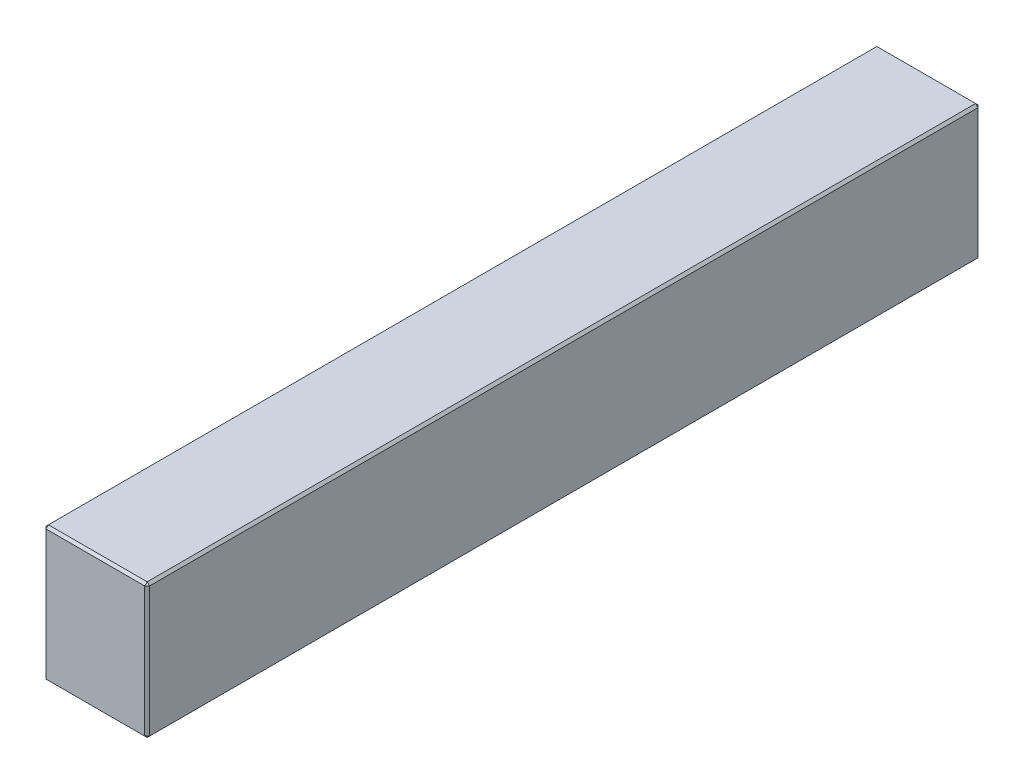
ISO-10303-21;
HEADER;
FILE_DESCRIPTION(('STEP AP214'),'2;1');
FILE_NAME('part.step','',(''),(''),'','','');
FILE_SCHEMA(('AUTOMOTIVE_DESIGN { 1 0 10303 214 1 1 1 1 }'));
ENDSEC;
DATA;
#1=APPLICATION_CONTEXT('core data for automotive mechanical design processes');
#2=APPLICATION_PROTOCOL_DEFINITION('international standard','automotive_design',2000,#1);
#3=PRODUCT_CONTEXT('',#1,'mechanical');
#4=PRODUCT('Part','Part','',(#3));
#5=PRODUCT_RELATED_PRODUCT_CATEGORY('part','',(#4));
#6=PRODUCT_DEFINITION_FORMATION('','',#4);
#7=PRODUCT_DEFINITION_CONTEXT('part definition',#1,'design');
#8=PRODUCT_DEFINITION('design','',#6,#7);
#9=PRODUCT_DEFINITION_SHAPE('','',#8);
#10=(LENGTH_UNIT() NAMED_UNIT(*) SI_UNIT(.MILLI.,.METRE.));
#11=(NAMED_UNIT(*) PLANE_ANGLE_UNIT() SI_UNIT($,.RADIAN.));
#12=(NAMED_UNIT(*) SI_UNIT($,.STERADIAN.) SOLID_ANGLE_UNIT());
#13=UNCERTAINTY_MEASURE_WITH_UNIT(LENGTH_MEASURE(1.E-05),#10,'distance_accuracy_value','');
#14=(GEOMETRIC_REPRESENTATION_CONTEXT(3) GLOBAL_UNCERTAINTY_ASSIGNED_CONTEXT((#13)) GLOBAL_UNIT_ASSIGNED_CONTEXT((#10,
#11,#12)) REPRESENTATION_CONTEXT('',''));
#15=CARTESIAN_POINT('',(0.,0.,0.));
#16=DIRECTION('',(0.,0.,1.));
#17=DIRECTION('',(1.,0.,0.));
#18=AXIS2_PLACEMENT_3D('',#15,#16,#17);
#19=CARTESIAN_POINT('',(-21.5,56.,173.));
#20=DIRECTION('',(1.,0.,0.));
#21=DIRECTION('',(0.,0.,-1.));
#22=AXIS2_PLACEMENT_3D('',#19,#20,#21);
#23=PLANE('',#22);
#24=DIRECTION('',(0.,-1.,0.));
#25=VECTOR('',#24,1.);
#26=CARTESIAN_POINT('',(-21.5,56.,-172.));
#27=LINE('',#26,#25);
#28=CARTESIAN_POINT('',(-21.5,55.,-172.));
#29=VERTEX_POINT('',#28);
#30=CARTESIAN_POINT('',(-21.5,1.,-172.));
#31=VERTEX_POINT('',#30);
#32=EDGE_CURVE('E114',#29,#31,#27,.T.);
#33=ORIENTED_EDGE('',*,*,#32,.T.);
#34=DIRECTION('',(0.,0.,1.));
#35=VECTOR('',#34,1.);
#36=CARTESIAN_POINT('',(-21.5,1.,173.));
#37=LINE('',#36,#35);
#38=CARTESIAN_POINT('',(-21.5,1.,172.));
#39=VERTEX_POINT('',#38);
#40=EDGE_CURVE('E110',#31,#39,#37,.T.);
#41=ORIENTED_EDGE('',*,*,#40,.T.);
#42=DIRECTION('',(0.,1.,0.));
#43=VECTOR('',#42,1.);
#44=CARTESIAN_POINT('',(-21.5,56.,172.));
#45=LINE('',#44,#43);
#46=CARTESIAN_POINT('',(-21.5,55.,172.));
#47=VERTEX_POINT('',#46);
#48=EDGE_CURVE('E103',#39,#47,#45,.T.);
#49=ORIENTED_EDGE('',*,*,#48,.T.);
#50=DIRECTION('',(0.,0.,-1.));
#51=VECTOR('',#50,1.);
#52=CARTESIAN_POINT('',(-21.5,55.,-173.));
#53=LINE('',#52,#51);
#54=EDGE_CURVE('E107',#47,#29,#53,.T.);
#55=ORIENTED_EDGE('',*,*,#54,.T.);
#56=EDGE_LOOP('',(#33,#41,#49,#55));
#57=FACE_BOUND('',#56,.T.);
#58=ADVANCED_FACE('F15',(#57),#23,.F.);
#59=CARTESIAN_POINT('',(21.5,56.,173.));
#60=DIRECTION('',(0.,0.,-1.));
#61=DIRECTION('',(-1.,0.,0.));
#62=AXIS2_PLACEMENT_3D('',#59,#60,#61);
#63=PLANE('',#62);
#64=DIRECTION('',(-1.,0.,0.));
#65=VECTOR('',#64,1.);
#66=CARTESIAN_POINT('',(-21.5,55.,173.));
#67=LINE('',#66,#65);
#68=CARTESIAN_POINT('',(20.5,55.,173.));
#69=VERTEX_POINT('',#68);
#70=CARTESIAN_POINT('',(-20.5,55.,173.));
#71=VERTEX_POINT('',#70);
#72=EDGE_CURVE('E164',#69,#71,#67,.T.);
#73=ORIENTED_EDGE('',*,*,#72,.T.);
#74=DIRECTION('',(0.,-1.,0.));
#75=VECTOR('',#74,1.);
#76=CARTESIAN_POINT('',(-20.5,56.,173.));
#77=LINE('',#76,#75);
#78=CARTESIAN_POINT('',(-20.5,0.999999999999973,173.));
#79=VERTEX_POINT('',#78);
#80=EDGE_CURVE('E122',#71,#79,#77,.T.);
#81=ORIENTED_EDGE('',*,*,#80,.T.);
#82=DIRECTION('',(1.,0.,0.));
#83=VECTOR('',#82,1.);
#84=CARTESIAN_POINT('',(21.5,0.999999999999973,173.));
#85=LINE('',#84,#83);
#86=CARTESIAN_POINT('',(20.5,0.999999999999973,173.));
#87=VERTEX_POINT('',#86);
#88=EDGE_CURVE('E168',#79,#87,#85,.T.);
#89=ORIENTED_EDGE('',*,*,#88,.T.);
#90=DIRECTION('',(0.,1.,0.));
#91=VECTOR('',#90,1.);
#92=CARTESIAN_POINT('',(20.5,56.,173.));
#93=LINE('',#92,#91);
#94=EDGE_CURVE('E166',#87,#69,#93,.T.);
#95=ORIENTED_EDGE('',*,*,#94,.T.);
#96=EDGE_LOOP('',(#73,#81,#89,#95));
#97=FACE_BOUND('',#96,.T.);
#98=ADVANCED_FACE('F275',(#97),#63,.F.);
#99=CARTESIAN_POINT('',(21.5,56.,173.));
#100=DIRECTION('',(-1.,0.,0.));
#101=DIRECTION('',(0.,0.,1.));
#102=AXIS2_PLACEMENT_3D('',#99,#100,#101);
#103=PLANE('',#102);
#104=DIRECTION('',(0.,0.,-1.));
#105=VECTOR('',#104,1.);
#106=CARTESIAN_POINT('',(21.5,0.999999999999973,173.));
#107=LINE('',#106,#105);
#108=CARTESIAN_POINT('',(21.5,0.999999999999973,172.));
#109=VERTEX_POINT('',#108);
#110=CARTESIAN_POINT('',(21.5,0.999999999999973,-172.));
#111=VERTEX_POINT('',#110);
#112=EDGE_CURVE('E159',#109,#111,#107,.T.);
#113=ORIENTED_EDGE('',*,*,#112,.T.);
#114=DIRECTION('',(0.,1.,0.));
#115=VECTOR('',#114,1.);
#116=CARTESIAN_POINT('',(21.5,56.,-172.));
#117=LINE('',#116,#115);
#118=CARTESIAN_POINT('',(21.5,55.,-172.));
#119=VERTEX_POINT('',#118);
#120=EDGE_CURVE('E161',#111,#119,#117,.T.);
#121=ORIENTED_EDGE('',*,*,#120,.T.);
#122=DIRECTION('',(0.,0.,1.));
#123=VECTOR('',#122,1.);
#124=CARTESIAN_POINT('',(21.5,55.,173.));
#125=LINE('',#124,#123);
#126=CARTESIAN_POINT('',(21.5,55.,172.));
#127=VERTEX_POINT('',#126);
#128=EDGE_CURVE('E155',#119,#127,#125,.T.);
#129=ORIENTED_EDGE('',*,*,#128,.T.);
#130=DIRECTION('',(0.,-1.,0.));
#131=VECTOR('',#130,1.);
#132=CARTESIAN_POINT('',(21.5,56.,172.));
#133=LINE('',#132,#131);
#134=EDGE_CURVE('E157',#127,#109,#133,.T.);
#135=ORIENTED_EDGE('',*,*,#134,.T.);
#136=EDGE_LOOP('',(#113,#121,#129,#135));
#137=FACE_BOUND('',#136,.T.);
#138=ADVANCED_FACE('F254',(#137),#103,.F.);
#139=CARTESIAN_POINT('',(21.5,56.,-173.));
#140=DIRECTION('',(0.,0.,1.));
#141=DIRECTION('',(1.,0.,0.));
#142=AXIS2_PLACEMENT_3D('',#139,#140,#141);
#143=PLANE('',#142);
#144=DIRECTION('',(0.,-1.,0.));
#145=VECTOR('',#144,1.);
#146=CARTESIAN_POINT('',(20.5,56.,-173.));
#147=LINE('',#146,#145);
#148=CARTESIAN_POINT('',(20.5,55.,-173.));
#149=VERTEX_POINT('',#148);
#150=CARTESIAN_POINT('',(20.5,0.999999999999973,-173.));
#151=VERTEX_POINT('',#150);
#152=EDGE_CURVE('E148',#149,#151,#147,.T.);
#153=ORIENTED_EDGE('',*,*,#152,.T.);
#154=DIRECTION('',(-1.,0.,0.));
#155=VECTOR('',#154,1.);
#156=CARTESIAN_POINT('',(21.5,0.999999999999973,-173.));
#157=LINE('',#156,#155);
#158=CARTESIAN_POINT('',(-20.5,0.999999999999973,-173.));
#159=VERTEX_POINT('',#158);
#160=EDGE_CURVE('E153',#151,#159,#157,.T.);
#161=ORIENTED_EDGE('',*,*,#160,.T.);
#162=DIRECTION('',(0.,1.,0.));
#163=VECTOR('',#162,1.);
#164=CARTESIAN_POINT('',(-20.5,56.,-173.));
#165=LINE('',#164,#163);
#166=CARTESIAN_POINT('',(-20.5,55.,-173.));
#167=VERTEX_POINT('',#166);
#168=EDGE_CURVE('E150',#159,#167,#165,.T.);
#169=ORIENTED_EDGE('',*,*,#168,.T.);
#170=DIRECTION('',(1.,0.,0.));
#171=VECTOR('',#170,1.);
#172=CARTESIAN_POINT('',(21.5,55.,-173.));
#173=LINE('',#172,#171);
#174=EDGE_CURVE('E146',#167,#149,#173,.T.);
#175=ORIENTED_EDGE('',*,*,#174,.T.);
#176=EDGE_LOOP('',(#153,#161,#169,#175));
#177=FACE_BOUND('',#176,.T.);
#178=ADVANCED_FACE('F284',(#177),#143,.F.);
#179=CARTESIAN_POINT('',(0.,56.,0.));
#180=DIRECTION('',(0.,1.,0.));
#181=DIRECTION('',(0.,0.,1.));
#182=AXIS2_PLACEMENT_3D('',#179,#180,#181);
#183=PLANE('',#182);
#184=DIRECTION('',(0.,0.,-1.));
#185=VECTOR('',#184,1.);
#186=CARTESIAN_POINT('',(20.5,56.,-173.));
#187=LINE('',#186,#185);
#188=CARTESIAN_POINT('',(20.5,56.,172.));
#189=VERTEX_POINT('',#188);
#190=CARTESIAN_POINT('',(20.5,56.,-172.));
#191=VERTEX_POINT('',#190);
#192=EDGE_CURVE('E24',#189,#191,#187,.T.);
#193=ORIENTED_EDGE('',*,*,#192,.T.);
#194=DIRECTION('',(-1.,0.,0.));
#195=VECTOR('',#194,1.);
#196=CARTESIAN_POINT('',(-21.5,56.,-172.));
#197=LINE('',#196,#195);
#198=CARTESIAN_POINT('',(-20.5,56.,-172.));
#199=VERTEX_POINT('',#198);
#200=EDGE_CURVE('E9',#191,#199,#197,.T.);
#201=ORIENTED_EDGE('',*,*,#200,.T.);
#202=DIRECTION('',(0.,0.,1.));
#203=VECTOR('',#202,1.);
#204=CARTESIAN_POINT('',(-20.5,56.,173.));
#205=LINE('',#204,#203);
#206=CARTESIAN_POINT('',(-20.5,56.,172.));
#207=VERTEX_POINT('',#206);
#208=EDGE_CURVE('E180',#199,#207,#205,.T.);
#209=ORIENTED_EDGE('',*,*,#208,.T.);
#210=DIRECTION('',(1.,0.,0.));
#211=VECTOR('',#210,1.);
#212=CARTESIAN_POINT('',(21.5,56.,172.));
#213=LINE('',#212,#211);
#214=EDGE_CURVE('E35',#207,#189,#213,.T.);
#215=ORIENTED_EDGE('',*,*,#214,.T.);
#216=EDGE_LOOP('',(#193,#201,#209,#215));
#217=FACE_BOUND('',#216,.T.);
#218=ADVANCED_FACE('F350',(#217),#183,.T.);
#219=CARTESIAN_POINT('',(0.,0.,0.));
#220=DIRECTION('',(0.,1.,0.));
#221=DIRECTION('',(0.,0.,1.));
#222=AXIS2_PLACEMENT_3D('',#219,#220,#221);
#223=PLANE('',#222);
#224=DIRECTION('',(0.,0.,1.));
#225=VECTOR('',#224,1.);
#226=CARTESIAN_POINT('',(20.5,0.,0.));
#227=LINE('',#226,#225);
#228=CARTESIAN_POINT('',(20.5,0.,-172.));
#229=VERTEX_POINT('',#228);
#230=CARTESIAN_POINT('',(20.5,0.,172.));
#231=VERTEX_POINT('',#230);
#232=EDGE_CURVE('E171',#229,#231,#227,.T.);
#233=ORIENTED_EDGE('',*,*,#232,.T.);
#234=DIRECTION('',(-1.,0.,0.));
#235=VECTOR('',#234,1.);
#236=CARTESIAN_POINT('',(0.,0.,172.));
#237=LINE('',#236,#235);
#238=CARTESIAN_POINT('',(-20.5,0.,172.));
#239=VERTEX_POINT('',#238);
#240=EDGE_CURVE('E177',#231,#239,#237,.T.);
#241=ORIENTED_EDGE('',*,*,#240,.T.);
#242=DIRECTION('',(0.,0.,-1.));
#243=VECTOR('',#242,1.);
#244=CARTESIAN_POINT('',(-20.5,0.,0.));
#245=LINE('',#244,#243);
#246=CARTESIAN_POINT('',(-20.5,0.,-172.));
#247=VERTEX_POINT('',#246);
#248=EDGE_CURVE('E175',#239,#247,#245,.T.);
#249=ORIENTED_EDGE('',*,*,#248,.T.);
#250=DIRECTION('',(1.,0.,0.));
#251=VECTOR('',#250,1.);
#252=CARTESIAN_POINT('',(0.,0.,-172.));
#253=LINE('',#252,#251);
#254=EDGE_CURVE('E173',#247,#229,#253,.T.);
#255=ORIENTED_EDGE('',*,*,#254,.T.);
#256=EDGE_LOOP('',(#233,#241,#249,#255));
#257=FACE_BOUND('',#256,.T.);
#258=ADVANCED_FACE('F246',(#257),#223,.F.);
#259=CARTESIAN_POINT('',(21.5,56.,172.));
#260=DIRECTION('',(-0.707106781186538,0.,-0.707106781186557));
#261=DIRECTION('',(0.,-1.,0.));
#262=AXIS2_PLACEMENT_3D('',#259,#260,#261);
#263=PLANE('',#262);
#264=DIRECTION('',(-0.707106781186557,0.,0.707106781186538));
#265=VECTOR('',#264,1.);
#266=CARTESIAN_POINT('',(20.5,55.,173.));
#267=LINE('',#266,#265);
#268=EDGE_CURVE('E19',#69,#127,#267,.F.);
#269=ORIENTED_EDGE('',*,*,#268,.F.);
#270=ORIENTED_EDGE('',*,*,#94,.F.);
#271=DIRECTION('',(0.707106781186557,0.,-0.707106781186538));
#272=VECTOR('',#271,1.);
#273=CARTESIAN_POINT('',(20.5,0.999999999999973,173.));
#274=LINE('',#273,#272);
#275=EDGE_CURVE('E142',#109,#87,#274,.F.);
#276=ORIENTED_EDGE('',*,*,#275,.F.);
#277=ORIENTED_EDGE('',*,*,#134,.F.);
#278=EDGE_LOOP('',(#269,#270,#276,#277));
#279=FACE_BOUND('',#278,.T.);
#280=ADVANCED_FACE('F17',(#279),#263,.F.);
#281=CARTESIAN_POINT('',(20.5,55.,173.));
#282=DIRECTION('',(0.577350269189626,0.57735026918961,0.577350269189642));
#283=DIRECTION('',(0.707106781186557,0.,-0.707106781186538));
#284=AXIS2_PLACEMENT_3D('',#281,#282,#283);
#285=PLANE('',#284);
#286=DIRECTION('',(0.,-0.707106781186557,0.707106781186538));
#287=VECTOR('',#286,1.);
#288=CARTESIAN_POINT('',(20.5,55.,173.));
#289=LINE('',#288,#287);
#290=EDGE_CURVE('E226',#69,#189,#289,.F.);
#291=ORIENTED_EDGE('',*,*,#290,.F.);
#292=ORIENTED_EDGE('',*,*,#268,.T.);
#293=DIRECTION('',(-0.707106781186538,0.707106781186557,0.));
#294=VECTOR('',#293,1.);
#295=CARTESIAN_POINT('',(21.,55.5,172.));
#296=LINE('',#295,#294);
#297=EDGE_CURVE('E228',#189,#127,#296,.F.);
#298=ORIENTED_EDGE('',*,*,#297,.F.);
#299=EDGE_LOOP('',(#291,#292,#298));
#300=FACE_BOUND('',#299,.T.);
#301=ADVANCED_FACE('F270',(#300),#285,.T.);
#302=CARTESIAN_POINT('',(20.5,0.999999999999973,173.));
#303=DIRECTION('',(0.57735026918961,-0.577350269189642,0.577350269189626));
#304=DIRECTION('',(0.,-0.707106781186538,-0.707106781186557));
#305=AXIS2_PLACEMENT_3D('',#302,#303,#304);
#306=PLANE('',#305);
#307=DIRECTION('',(-0.707106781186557,-0.707106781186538,0.));
#308=VECTOR('',#307,1.);
#309=CARTESIAN_POINT('',(21.,0.499999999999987,172.));
#310=LINE('',#309,#308);
#311=EDGE_CURVE('E220',#109,#231,#310,.T.);
#312=ORIENTED_EDGE('',*,*,#311,.F.);
#313=ORIENTED_EDGE('',*,*,#275,.T.);
#314=DIRECTION('',(0.,0.707106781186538,0.707106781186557));
#315=VECTOR('',#314,1.);
#316=CARTESIAN_POINT('',(20.5,0.999999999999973,173.));
#317=LINE('',#316,#315);
#318=EDGE_CURVE('E223',#231,#87,#317,.T.);
#319=ORIENTED_EDGE('',*,*,#318,.F.);
#320=EDGE_LOOP('',(#312,#313,#319));
#321=FACE_BOUND('',#320,.T.);
#322=ADVANCED_FACE('F235',(#321),#306,.T.);
#323=CARTESIAN_POINT('',(20.5,56.,0.));
#324=DIRECTION('',(0.707106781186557,0.707106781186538,0.));
#325=DIRECTION('',(0.,0.,1.));
#326=AXIS2_PLACEMENT_3D('',#323,#324,#325);
#327=PLANE('',#326);
#328=ORIENTED_EDGE('',*,*,#297,.T.);
#329=ORIENTED_EDGE('',*,*,#128,.F.);
#330=DIRECTION('',(0.707106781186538,-0.707106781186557,0.));
#331=VECTOR('',#330,1.);
#332=CARTESIAN_POINT('',(21.5,55.,-172.));
#333=LINE('',#332,#331);
#334=EDGE_CURVE('E215',#191,#119,#333,.T.);
#335=ORIENTED_EDGE('',*,*,#334,.F.);
#336=ORIENTED_EDGE('',*,*,#192,.F.);
#337=EDGE_LOOP('',(#328,#329,#335,#336));
#338=FACE_BOUND('',#337,.T.);
#339=ADVANCED_FACE('F265',(#338),#327,.T.);
#340=CARTESIAN_POINT('',(0.,56.,172.));
#341=DIRECTION('',(0.,0.707106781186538,0.707106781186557));
#342=DIRECTION('',(-1.,0.,0.));
#343=AXIS2_PLACEMENT_3D('',#340,#341,#342);
#344=PLANE('',#343);
#345=ORIENTED_EDGE('',*,*,#290,.T.);
#346=ORIENTED_EDGE('',*,*,#214,.F.);
#347=DIRECTION('',(0.,0.707106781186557,-0.707106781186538));
#348=VECTOR('',#347,1.);
#349=CARTESIAN_POINT('',(-20.5,55.5,172.5));
#350=LINE('',#349,#348);
#351=EDGE_CURVE('E126',#71,#207,#350,.T.);
#352=ORIENTED_EDGE('',*,*,#351,.F.);
#353=ORIENTED_EDGE('',*,*,#72,.F.);
#354=EDGE_LOOP('',(#345,#346,#352,#353));
#355=FACE_BOUND('',#354,.T.);
#356=ADVANCED_FACE('F273',(#355),#344,.T.);
#357=CARTESIAN_POINT('',(-20.5,56.,173.));
#358=DIRECTION('',(0.707106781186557,0.,-0.707106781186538));
#359=DIRECTION('',(0.,-1.,0.));
#360=AXIS2_PLACEMENT_3D('',#357,#358,#359);
#361=PLANE('',#360);
#362=DIRECTION('',(0.707106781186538,0.,0.707106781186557));
#363=VECTOR('',#362,1.);
#364=CARTESIAN_POINT('',(-20.5,0.999999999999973,173.));
#365=LINE('',#364,#363);
#366=EDGE_CURVE('E127',#79,#39,#365,.F.);
#367=ORIENTED_EDGE('',*,*,#366,.F.);
#368=ORIENTED_EDGE('',*,*,#80,.F.);
#369=DIRECTION('',(-0.707106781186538,0.,-0.707106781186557));
#370=VECTOR('',#369,1.);
#371=CARTESIAN_POINT('',(-21.5,55.,172.));
#372=LINE('',#371,#370);
#373=EDGE_CURVE('E118',#47,#71,#372,.F.);
#374=ORIENTED_EDGE('',*,*,#373,.F.);
#375=ORIENTED_EDGE('',*,*,#48,.F.);
#376=EDGE_LOOP('',(#367,#368,#374,#375));
#377=FACE_BOUND('',#376,.T.);
#378=ADVANCED_FACE('F120',(#377),#361,.F.);
#379=CARTESIAN_POINT('',(21.5,0.999999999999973,173.));
#380=DIRECTION('',(0.,0.707106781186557,-0.707106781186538));
#381=DIRECTION('',(1.,0.,0.));
#382=AXIS2_PLACEMENT_3D('',#379,#380,#381);
#383=PLANE('',#382);
#384=ORIENTED_EDGE('',*,*,#318,.T.);
#385=ORIENTED_EDGE('',*,*,#88,.F.);
#386=DIRECTION('',(0.,-0.707106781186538,-0.707106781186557));
#387=VECTOR('',#386,1.);
#388=CARTESIAN_POINT('',(-20.5,0.999999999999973,173.));
#389=LINE('',#388,#387);
#390=EDGE_CURVE('E211',#239,#79,#389,.F.);
#391=ORIENTED_EDGE('',*,*,#390,.F.);
#392=ORIENTED_EDGE('',*,*,#240,.F.);
#393=EDGE_LOOP('',(#384,#385,#391,#392));
#394=FACE_BOUND('',#393,.T.);
#395=ADVANCED_FACE('F243',(#394),#383,.F.);
#396=CARTESIAN_POINT('',(21.5,0.999999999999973,173.));
#397=DIRECTION('',(-0.707106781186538,0.707106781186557,0.));
#398=DIRECTION('',(0.,0.,-1.));
#399=AXIS2_PLACEMENT_3D('',#396,#397,#398);
#400=PLANE('',#399);
#401=ORIENTED_EDGE('',*,*,#311,.T.);
#402=ORIENTED_EDGE('',*,*,#232,.F.);
#403=DIRECTION('',(0.707106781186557,0.707106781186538,0.));
#404=VECTOR('',#403,1.);
#405=CARTESIAN_POINT('',(21.,0.499999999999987,-172.));
#406=LINE('',#405,#404);
#407=EDGE_CURVE('E208',#111,#229,#406,.F.);
#408=ORIENTED_EDGE('',*,*,#407,.F.);
#409=ORIENTED_EDGE('',*,*,#112,.F.);
#410=EDGE_LOOP('',(#401,#402,#408,#409));
#411=FACE_BOUND('',#410,.T.);
#412=ADVANCED_FACE('F251',(#411),#400,.F.);
#413=CARTESIAN_POINT('',(20.5,56.,-173.));
#414=DIRECTION('',(-0.707106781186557,0.,0.707106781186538));
#415=DIRECTION('',(0.,-1.,0.));
#416=AXIS2_PLACEMENT_3D('',#413,#414,#415);
#417=PLANE('',#416);
#418=DIRECTION('',(0.707106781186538,0.,0.707106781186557));
#419=VECTOR('',#418,1.);
#420=CARTESIAN_POINT('',(21.5,55.,-172.));
#421=LINE('',#420,#419);
#422=EDGE_CURVE('E217',#119,#149,#421,.F.);
#423=ORIENTED_EDGE('',*,*,#422,.F.);
#424=ORIENTED_EDGE('',*,*,#120,.F.);
#425=DIRECTION('',(-0.707106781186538,0.,-0.707106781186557));
#426=VECTOR('',#425,1.);
#427=CARTESIAN_POINT('',(20.5,0.999999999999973,-173.));
#428=LINE('',#427,#426);
#429=EDGE_CURVE('E205',#151,#111,#428,.F.);
#430=ORIENTED_EDGE('',*,*,#429,.F.);
#431=ORIENTED_EDGE('',*,*,#152,.F.);
#432=EDGE_LOOP('',(#423,#424,#430,#431));
#433=FACE_BOUND('',#432,.T.);
#434=ADVANCED_FACE('F258',(#433),#417,.F.);
#435=CARTESIAN_POINT('',(21.5,55.,-172.));
#436=DIRECTION('',(0.577350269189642,0.57735026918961,-0.577350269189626));
#437=DIRECTION('',(-0.707106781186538,0.,-0.707106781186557));
#438=AXIS2_PLACEMENT_3D('',#435,#436,#437);
#439=PLANE('',#438);
#440=ORIENTED_EDGE('',*,*,#334,.T.);
#441=ORIENTED_EDGE('',*,*,#422,.T.);
#442=DIRECTION('',(0.,0.707106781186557,0.707106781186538));
#443=VECTOR('',#442,1.);
#444=CARTESIAN_POINT('',(20.5,55.5,-172.5));
#445=LINE('',#444,#443);
#446=EDGE_CURVE('E134',#191,#149,#445,.F.);
#447=ORIENTED_EDGE('',*,*,#446,.F.);
#448=EDGE_LOOP('',(#440,#441,#447));
#449=FACE_BOUND('',#448,.T.);
#450=ADVANCED_FACE('F325',(#449),#439,.T.);
#451=CARTESIAN_POINT('',(-21.5,55.,172.));
#452=DIRECTION('',(-0.577350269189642,0.57735026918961,0.577350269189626));
#453=DIRECTION('',(0.707106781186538,0.,0.707106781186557));
#454=AXIS2_PLACEMENT_3D('',#451,#452,#453);
#455=PLANE('',#454);
#456=ORIENTED_EDGE('',*,*,#373,.T.);
#457=ORIENTED_EDGE('',*,*,#351,.T.);
#458=DIRECTION('',(-0.707106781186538,-0.707106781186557,0.));
#459=VECTOR('',#458,1.);
#460=CARTESIAN_POINT('',(-21.5,55.,172.));
#461=LINE('',#460,#459);
#462=EDGE_CURVE('E130',#47,#207,#461,.F.);
#463=ORIENTED_EDGE('',*,*,#462,.F.);
#464=EDGE_LOOP('',(#456,#457,#463));
#465=FACE_BOUND('',#464,.T.);
#466=ADVANCED_FACE('F131',(#465),#455,.T.);
#467=CARTESIAN_POINT('',(-20.5,0.999999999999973,173.));
#468=DIRECTION('',(-0.577350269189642,-0.577350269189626,0.57735026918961));
#469=DIRECTION('',(0.707106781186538,-0.707106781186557,0.));
#470=AXIS2_PLACEMENT_3D('',#467,#468,#469);
#471=PLANE('',#470);
#472=ORIENTED_EDGE('',*,*,#390,.T.);
#473=ORIENTED_EDGE('',*,*,#366,.T.);
#474=DIRECTION('',(-0.707106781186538,0.707106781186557,0.));
#475=VECTOR('',#474,1.);
#476=CARTESIAN_POINT('',(-21.,0.5,172.));
#477=LINE('',#476,#475);
#478=EDGE_CURVE('E135',#239,#39,#477,.T.);
#479=ORIENTED_EDGE('',*,*,#478,.F.);
#480=EDGE_LOOP('',(#472,#473,#479));
#481=FACE_BOUND('',#480,.T.);
#482=ADVANCED_FACE('F318',(#481),#471,.T.);
#483=CARTESIAN_POINT('',(20.5,0.999999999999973,-173.));
#484=DIRECTION('',(0.577350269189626,-0.577350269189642,-0.57735026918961));
#485=DIRECTION('',(0.707106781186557,0.707106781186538,0.));
#486=AXIS2_PLACEMENT_3D('',#483,#484,#485);
#487=PLANE('',#486);
#488=ORIENTED_EDGE('',*,*,#429,.T.);
#489=ORIENTED_EDGE('',*,*,#407,.T.);
#490=DIRECTION('',(0.,-0.707106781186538,0.707106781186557));
#491=VECTOR('',#490,1.);
#492=CARTESIAN_POINT('',(20.5,0.999999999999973,-173.));
#493=LINE('',#492,#491);
#494=EDGE_CURVE('E198',#151,#229,#493,.T.);
#495=ORIENTED_EDGE('',*,*,#494,.F.);
#496=EDGE_LOOP('',(#488,#489,#495));
#497=FACE_BOUND('',#496,.T.);
#498=ADVANCED_FACE('F314',(#497),#487,.T.);
#499=CARTESIAN_POINT('',(0.,56.,-172.));
#500=DIRECTION('',(0.,0.707106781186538,-0.707106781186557));
#501=DIRECTION('',(1.,0.,0.));
#502=AXIS2_PLACEMENT_3D('',#499,#500,#501);
#503=PLANE('',#502);
#504=ORIENTED_EDGE('',*,*,#446,.T.);
#505=ORIENTED_EDGE('',*,*,#174,.F.);
#506=DIRECTION('',(0.,-0.707106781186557,-0.707106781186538));
#507=VECTOR('',#506,1.);
#508=CARTESIAN_POINT('',(-20.5,55.,-173.));
#509=LINE('',#508,#507);
#510=EDGE_CURVE('E195',#199,#167,#509,.T.);
#511=ORIENTED_EDGE('',*,*,#510,.F.);
#512=ORIENTED_EDGE('',*,*,#200,.F.);
#513=EDGE_LOOP('',(#504,#505,#511,#512));
#514=FACE_BOUND('',#513,.T.);
#515=ADVANCED_FACE('F311',(#514),#503,.T.);
#516=CARTESIAN_POINT('',(-20.5,56.,0.));
#517=DIRECTION('',(-0.707106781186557,0.707106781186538,0.));
#518=DIRECTION('',(0.,0.,-1.));
#519=AXIS2_PLACEMENT_3D('',#516,#517,#518);
#520=PLANE('',#519);
#521=ORIENTED_EDGE('',*,*,#462,.T.);
#522=ORIENTED_EDGE('',*,*,#208,.F.);
#523=DIRECTION('',(0.707106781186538,0.707106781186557,0.));
#524=VECTOR('',#523,1.);
#525=CARTESIAN_POINT('',(-21.,55.5,-172.));
#526=LINE('',#525,#524);
#527=EDGE_CURVE('E138',#29,#199,#526,.T.);
#528=ORIENTED_EDGE('',*,*,#527,.F.);
#529=ORIENTED_EDGE('',*,*,#54,.F.);
#530=EDGE_LOOP('',(#521,#522,#528,#529));
#531=FACE_BOUND('',#530,.T.);
#532=ADVANCED_FACE('F137',(#531),#520,.T.);
#533=CARTESIAN_POINT('',(-21.5,1.,173.));
#534=DIRECTION('',(0.707106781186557,0.707106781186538,0.));
#535=DIRECTION('',(0.,0.,1.));
#536=AXIS2_PLACEMENT_3D('',#533,#534,#535);
#537=PLANE('',#536);
#538=ORIENTED_EDGE('',*,*,#478,.T.);
#539=ORIENTED_EDGE('',*,*,#40,.F.);
#540=DIRECTION('',(0.707106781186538,-0.707106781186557,0.));
#541=VECTOR('',#540,1.);
#542=CARTESIAN_POINT('',(-21.5,1.,-172.));
#543=LINE('',#542,#541);
#544=EDGE_CURVE('E191',#247,#31,#543,.F.);
#545=ORIENTED_EDGE('',*,*,#544,.F.);
#546=ORIENTED_EDGE('',*,*,#248,.F.);
#547=EDGE_LOOP('',(#538,#539,#545,#546));
#548=FACE_BOUND('',#547,.T.);
#549=ADVANCED_FACE('F304',(#548),#537,.F.);
#550=CARTESIAN_POINT('',(21.5,0.999999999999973,-173.));
#551=DIRECTION('',(0.,0.707106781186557,0.707106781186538));
#552=DIRECTION('',(-1.,0.,0.));
#553=AXIS2_PLACEMENT_3D('',#550,#551,#552);
#554=PLANE('',#553);
#555=ORIENTED_EDGE('',*,*,#494,.T.);
#556=ORIENTED_EDGE('',*,*,#254,.F.);
#557=DIRECTION('',(0.,0.707106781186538,-0.707106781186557));
#558=VECTOR('',#557,1.);
#559=CARTESIAN_POINT('',(-20.5,0.499999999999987,-172.5));
#560=LINE('',#559,#558);
#561=EDGE_CURVE('E188',#159,#247,#560,.F.);
#562=ORIENTED_EDGE('',*,*,#561,.F.);
#563=ORIENTED_EDGE('',*,*,#160,.F.);
#564=EDGE_LOOP('',(#555,#556,#562,#563));
#565=FACE_BOUND('',#564,.T.);
#566=ADVANCED_FACE('F300',(#565),#554,.F.);
#567=CARTESIAN_POINT('',(-20.5,55.,-173.));
#568=DIRECTION('',(-0.577350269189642,0.57735026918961,-0.577350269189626));
#569=DIRECTION('',(-0.707106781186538,0.,0.707106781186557));
#570=AXIS2_PLACEMENT_3D('',#567,#568,#569);
#571=PLANE('',#570);
#572=ORIENTED_EDGE('',*,*,#527,.T.);
#573=ORIENTED_EDGE('',*,*,#510,.T.);
#574=DIRECTION('',(0.707106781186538,0.,-0.707106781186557));
#575=VECTOR('',#574,1.);
#576=CARTESIAN_POINT('',(-20.5,55.,-173.));
#577=LINE('',#576,#575);
#578=EDGE_CURVE('E186',#29,#167,#577,.T.);
#579=ORIENTED_EDGE('',*,*,#578,.F.);
#580=EDGE_LOOP('',(#572,#573,#579));
#581=FACE_BOUND('',#580,.T.);
#582=ADVANCED_FACE('F296',(#581),#571,.T.);
#583=CARTESIAN_POINT('',(-21.5,1.,-172.));
#584=DIRECTION('',(-0.577350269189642,-0.577350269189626,-0.57735026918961));
#585=DIRECTION('',(0.707106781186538,-0.707106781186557,0.));
#586=AXIS2_PLACEMENT_3D('',#583,#584,#585);
#587=PLANE('',#586);
#588=ORIENTED_EDGE('',*,*,#561,.T.);
#589=ORIENTED_EDGE('',*,*,#544,.T.);
#590=DIRECTION('',(-0.707106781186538,0.,0.707106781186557));
#591=VECTOR('',#590,1.);
#592=CARTESIAN_POINT('',(-21.5,1.,-172.));
#593=LINE('',#592,#591);
#594=EDGE_CURVE('E184',#159,#31,#593,.T.);
#595=ORIENTED_EDGE('',*,*,#594,.F.);
#596=EDGE_LOOP('',(#588,#589,#595));
#597=FACE_BOUND('',#596,.T.);
#598=ADVANCED_FACE('F292',(#597),#587,.T.);
#599=CARTESIAN_POINT('',(-21.5,56.,-172.));
#600=DIRECTION('',(0.707106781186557,0.,0.707106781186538));
#601=DIRECTION('',(0.,-1.,0.));
#602=AXIS2_PLACEMENT_3D('',#599,#600,#601);
#603=PLANE('',#602);
#604=ORIENTED_EDGE('',*,*,#578,.T.);
#605=ORIENTED_EDGE('',*,*,#168,.F.);
#606=ORIENTED_EDGE('',*,*,#594,.T.);
#607=ORIENTED_EDGE('',*,*,#32,.F.);
#608=EDGE_LOOP('',(#604,#605,#606,#607));
#609=FACE_BOUND('',#608,.T.);
#610=ADVANCED_FACE('F289',(#609),#603,.F.);
#611=CLOSED_SHELL('',(#58,#98,#138,#178,#218,#258,#280,#301,#322,#339,#356,#378,#395,#412,#434,
#450,#466,#482,#498,#515,#532,#549,#566,#582,#598,#610));
#612=MANIFOLD_SOLID_BREP('B1',#611);
#613=ADVANCED_BREP_SHAPE_REPRESENTATION('',(#18,#612),#14);
#614=SHAPE_DEFINITION_REPRESENTATION(#9,#613);
ENDSEC;
END-ISO-10303-21;
